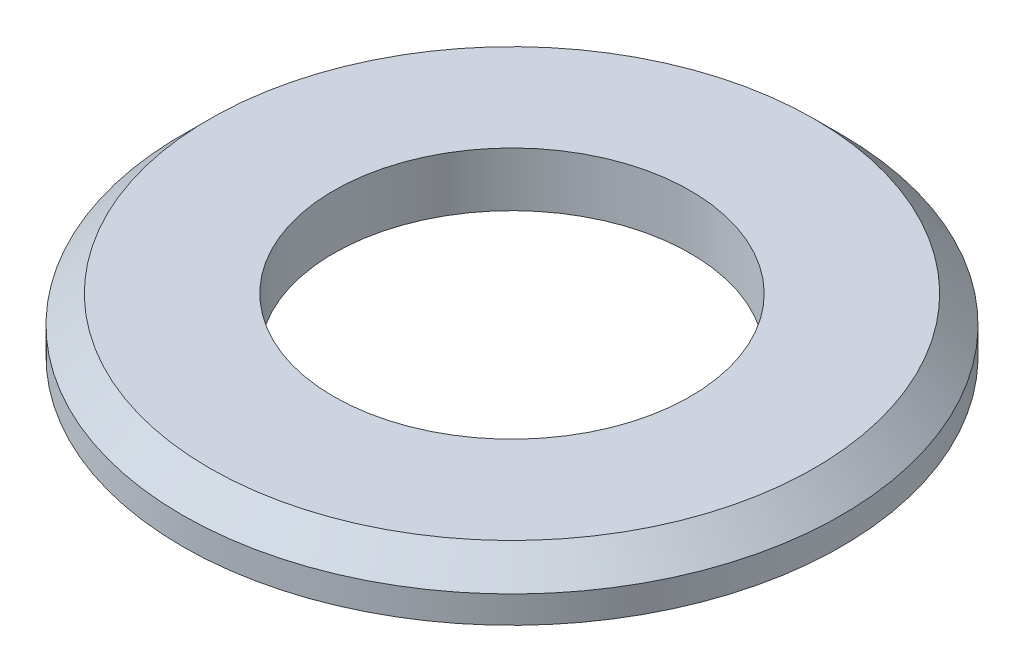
ISO-10303-21;
HEADER;
FILE_DESCRIPTION(('STEP AP214'),'2;1');
FILE_NAME('part.step','',(''),(''),'','','');
FILE_SCHEMA(('AUTOMOTIVE_DESIGN { 1 0 10303 214 1 1 1 1 }'));
ENDSEC;
DATA;
#1=APPLICATION_CONTEXT('core data for automotive mechanical design processes');
#2=APPLICATION_PROTOCOL_DEFINITION('international standard','automotive_design',2000,#1);
#3=PRODUCT_CONTEXT('',#1,'mechanical');
#4=PRODUCT('Part','Part','',(#3));
#5=PRODUCT_RELATED_PRODUCT_CATEGORY('part','',(#4));
#6=PRODUCT_DEFINITION_FORMATION('','',#4);
#7=PRODUCT_DEFINITION_CONTEXT('part definition',#1,'design');
#8=PRODUCT_DEFINITION('design','',#6,#7);
#9=PRODUCT_DEFINITION_SHAPE('','',#8);
#10=(LENGTH_UNIT() NAMED_UNIT(*) SI_UNIT(.MILLI.,.METRE.));
#11=(NAMED_UNIT(*) PLANE_ANGLE_UNIT() SI_UNIT($,.RADIAN.));
#12=(NAMED_UNIT(*) SI_UNIT($,.STERADIAN.) SOLID_ANGLE_UNIT());
#13=UNCERTAINTY_MEASURE_WITH_UNIT(LENGTH_MEASURE(1.E-05),#10,'distance_accuracy_value','');
#14=(GEOMETRIC_REPRESENTATION_CONTEXT(3) GLOBAL_UNCERTAINTY_ASSIGNED_CONTEXT((#13)) GLOBAL_UNIT_ASSIGNED_CONTEXT((#10,
#11,#12)) REPRESENTATION_CONTEXT('',''));
#15=CARTESIAN_POINT('',(0.,0.,0.));
#16=DIRECTION('',(0.,0.,1.));
#17=DIRECTION('',(1.,0.,0.));
#18=AXIS2_PLACEMENT_3D('',#15,#16,#17);
#19=CARTESIAN_POINT('',(0.,7.,0.));
#20=DIRECTION('',(0.,1.,0.));
#21=DIRECTION('',(0.,0.,1.));
#22=AXIS2_PLACEMENT_3D('',#19,#20,#21);
#23=PLANE('',#22);
#24=CARTESIAN_POINT('',(0.,7.,0.));
#25=DIRECTION('',(0.,1.,0.));
#26=DIRECTION('',(0.,0.,1.));
#27=AXIS2_PLACEMENT_3D('',#24,#25,#26);
#28=CIRCLE('',#27,39.);
#29=CARTESIAN_POINT('',(0.,7.,39.));
#30=VERTEX_POINT('',#29);
#31=EDGE_CURVE('E35',#30,#30,#28,.T.);
#32=ORIENTED_EDGE('',*,*,#31,.T.);
#33=EDGE_LOOP('',(#32));
#34=FACE_BOUND('',#33,.T.);
#35=CARTESIAN_POINT('',(0.,7.,0.));
#36=DIRECTION('',(0.,1.,0.));
#37=DIRECTION('',(0.,0.,1.));
#38=AXIS2_PLACEMENT_3D('',#35,#36,#37);
#39=CIRCLE('',#38,23.);
#40=CARTESIAN_POINT('',(0.,7.,23.));
#41=VERTEX_POINT('',#40);
#42=EDGE_CURVE('E43',#41,#41,#39,.T.);
#43=ORIENTED_EDGE('',*,*,#42,.F.);
#44=EDGE_LOOP('',(#43));
#45=FACE_BOUND('',#44,.T.);
#46=ADVANCED_FACE('F28',(#34,#45),#23,.T.);
#47=CARTESIAN_POINT('',(0.,0.,0.));
#48=DIRECTION('',(0.,1.,0.));
#49=DIRECTION('',(0.,0.,1.));
#50=AXIS2_PLACEMENT_3D('',#47,#48,#49);
#51=PLANE('',#50);
#52=CARTESIAN_POINT('',(0.,0.,0.));
#53=DIRECTION('',(0.,1.,0.));
#54=DIRECTION('',(0.,0.,1.));
#55=AXIS2_PLACEMENT_3D('',#52,#53,#54);
#56=CIRCLE('',#55,42.5);
#57=CARTESIAN_POINT('',(0.,0.,42.5));
#58=VERTEX_POINT('',#57);
#59=EDGE_CURVE('E39',#58,#58,#56,.T.);
#60=ORIENTED_EDGE('',*,*,#59,.F.);
#61=EDGE_LOOP('',(#60));
#62=FACE_BOUND('',#61,.T.);
#63=CARTESIAN_POINT('',(0.,0.,0.));
#64=DIRECTION('',(0.,1.,0.));
#65=DIRECTION('',(0.,0.,1.));
#66=AXIS2_PLACEMENT_3D('',#63,#64,#65);
#67=CIRCLE('',#66,23.);
#68=CARTESIAN_POINT('',(0.,0.,23.));
#69=VERTEX_POINT('',#68);
#70=EDGE_CURVE('E48',#69,#69,#67,.T.);
#71=ORIENTED_EDGE('',*,*,#70,.T.);
#72=EDGE_LOOP('',(#71));
#73=FACE_BOUND('',#72,.T.);
#74=ADVANCED_FACE('F52',(#62,#73),#51,.F.);
#75=CARTESIAN_POINT('',(0.,7.,0.));
#76=DIRECTION('',(0.,-1.,0.));
#77=DIRECTION('',(0.,0.,-1.));
#78=AXIS2_PLACEMENT_3D('',#75,#76,#77);
#79=CYLINDRICAL_SURFACE('',#78,42.5);
#80=CARTESIAN_POINT('',(0.,3.49999999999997,0.));
#81=DIRECTION('',(0.,1.,0.));
#82=DIRECTION('',(0.,0.,1.));
#83=AXIS2_PLACEMENT_3D('',#80,#81,#82);
#84=CIRCLE('',#83,42.5);
#85=CARTESIAN_POINT('',(0.,3.49999999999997,42.5));
#86=VERTEX_POINT('',#85);
#87=EDGE_CURVE('E10',#86,#86,#84,.F.);
#88=ORIENTED_EDGE('',*,*,#87,.T.);
#89=EDGE_LOOP('',(#88));
#90=FACE_BOUND('',#89,.T.);
#91=ORIENTED_EDGE('',*,*,#59,.T.);
#92=EDGE_LOOP('',(#91));
#93=FACE_BOUND('',#92,.T.);
#94=ADVANCED_FACE('F30',(#90,#93),#79,.T.);
#95=CARTESIAN_POINT('',(0.,7.,0.));
#96=DIRECTION('',(0.,-1.,0.));
#97=DIRECTION('',(0.,0.,-1.));
#98=AXIS2_PLACEMENT_3D('',#95,#96,#97);
#99=CYLINDRICAL_SURFACE('',#98,23.);
#100=ORIENTED_EDGE('',*,*,#42,.T.);
#101=EDGE_LOOP('',(#100));
#102=FACE_BOUND('',#101,.T.);
#103=ORIENTED_EDGE('',*,*,#70,.F.);
#104=EDGE_LOOP('',(#103));
#105=FACE_BOUND('',#104,.T.);
#106=ADVANCED_FACE('F54',(#102,#105),#99,.F.);
#107=CARTESIAN_POINT('',(0.,7.,0.));
#108=DIRECTION('',(0.,-1.,0.));
#109=DIRECTION('',(0.,0.,-1.));
#110=AXIS2_PLACEMENT_3D('',#107,#108,#109);
#111=CONICAL_SURFACE('',#110,39.,0.78539816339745);
#112=ORIENTED_EDGE('',*,*,#87,.F.);
#113=EDGE_LOOP('',(#112));
#114=FACE_BOUND('',#113,.T.);
#115=ORIENTED_EDGE('',*,*,#31,.F.);
#116=EDGE_LOOP('',(#115));
#117=FACE_BOUND('',#116,.T.);
#118=ADVANCED_FACE('F56',(#114,#117),#111,.T.);
#119=CLOSED_SHELL('',(#46,#74,#94,#106,#118));
#120=MANIFOLD_SOLID_BREP('B2',#119);
#121=ADVANCED_BREP_SHAPE_REPRESENTATION('',(#18,#120),#14);
#122=SHAPE_DEFINITION_REPRESENTATION(#9,#121);
ENDSEC;
END-ISO-10303-21;
